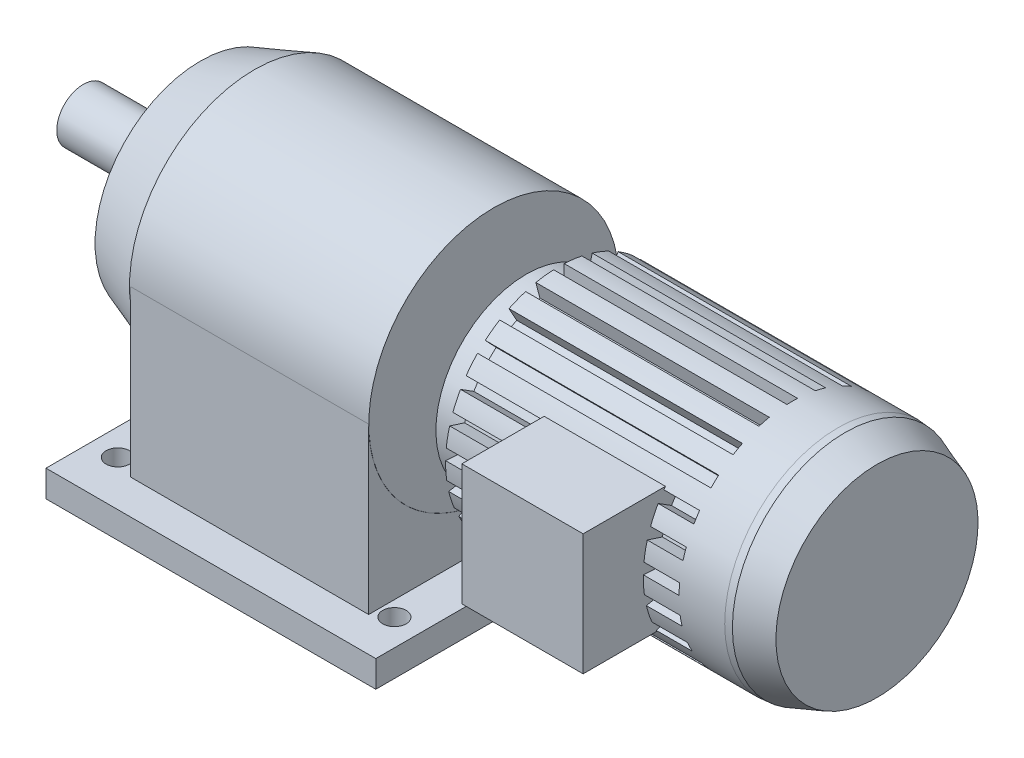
from build123d import *

# Parameters (mm, degrees)
SKETCH4_W           = 250
SKETCH4_H           = 15
CUT_EXTRUDE1_DEPTH  = 5
CIRPATTERN1_COUNT   = 25
SKETCH5_W           = 310
SKETCH5_H           = 25
BOSS_EXTRUDE1_DEPTH = 150
SKETCH6_W           = 235
SKETCH6_H           = 155
BOSS_EXTRUDE2_DEPTH = 223.9
SKETCH7_W           = 114
SKETCH7_H           = 114
BOSS_EXTRUDE3_DEPTH = 163
SKETCH8_R           = 11
CUT_EXTRUDE2_DEPTH  = 500.666778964


with BuildPart() as part:
    # Sketch1 → Revolve1 (revolve)
    with BuildSketch(Plane.XY):
        Polygon((-385.8, 0), (-385.8, 25), (-285.8, 25), (-285.8, 35), (-280.8, 35), (-280.8, 60), (-275.8, 60), (-275.8, 98.973915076), (-224.9, 117.5), (0, 117.5), (0, 0), align=None)
    revolve(axis=Axis((0, 0, 0), (-1, 0, 0)))

    # Sketch2 → Revolve2 (revolve)
    with BuildSketch(Plane.XY):
        Polygon((0, -6.3), (0, 33.7), (30.6, 33.7), (30.6, 78.7), (61.2, 78.7), (61.2, 100.2), (323.560362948, 100.2), (330.2, 99.619107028), (360.2, 88.7), (360.2, -6.3), align=None)
    revolve(axis=Axis((360.2, -6.3, 0), (-1, 0, 0)))

    # Sketch4 → Cut-Extrude1 (cut, symmetric)
    with BuildSketch(Plane.XY):
        with Locations((155.6, 92.7)):
            Rectangle(SKETCH4_W, SKETCH4_H)
    cut_extrude1 = extrude(amount=CUT_EXTRUDE1_DEPTH, both=True, mode=Mode.SUBTRACT)

    # CirPattern1: Cut-Extrude1 ×25 about axis
    cirpattern1_axis = Axis((0, -6.3, 0), (1, 0, 0))
    for i in range(1, CIRPATTERN1_COUNT):
        add(cut_extrude1.rotate(cirpattern1_axis, i * 360 / CIRPATTERN1_COUNT), mode=Mode.SUBTRACT)

    # Sketch6 → Boss-Extrude2 (add)
    with BuildSketch(Plane.ZY.offset(224)):
        with Locations((0, -77.5)):
            Rectangle(SKETCH6_W, SKETCH6_H)
    extrude(amount=-BOSS_EXTRUDE2_DEPTH)

    # Sketch7 → Boss-Extrude3 (add)
    with BuildSketch(Plane.XY):
        with Locations((190, 0)):
            Rectangle(SKETCH7_W, SKETCH7_H)
    extrude(amount=BOSS_EXTRUDE3_DEPTH)


with BuildPart() as body_2:
    # Sketch5 → Boss-Extrude1 (new, symmetric)
    with BuildSketch(Plane.XY):
        with Locations((-115.9, -167.5)):
            Rectangle(SKETCH5_W, SKETCH5_H)
    extrude(amount=BOSS_EXTRUDE1_DEPTH, both=True)

    # Sketch8 → Cut-Extrude2 (cut, through all)
    with BuildSketch(Plane(origin=(0, -155, 0), x_dir=(1, 0, 0), z_dir=(0, 1, 0))):
        with Locations(Location((-245.9, -107.5, 0), (0, 0, 270))):
            Circle(SKETCH8_R)
        with Locations(Location((14.1, -107.5, 0), (0, 0, 270))):
            Circle(SKETCH8_R)
    cut_extrude2 = extrude(amount=-CUT_EXTRUDE2_DEPTH, mode=Mode.SUBTRACT)

    # Mirror1: Cut-Extrude2 across plane
    add(cut_extrude2.mirror(Plane.XY), mode=Mode.SUBTRACT)


solid = Compound([part.part, body_2.part])
